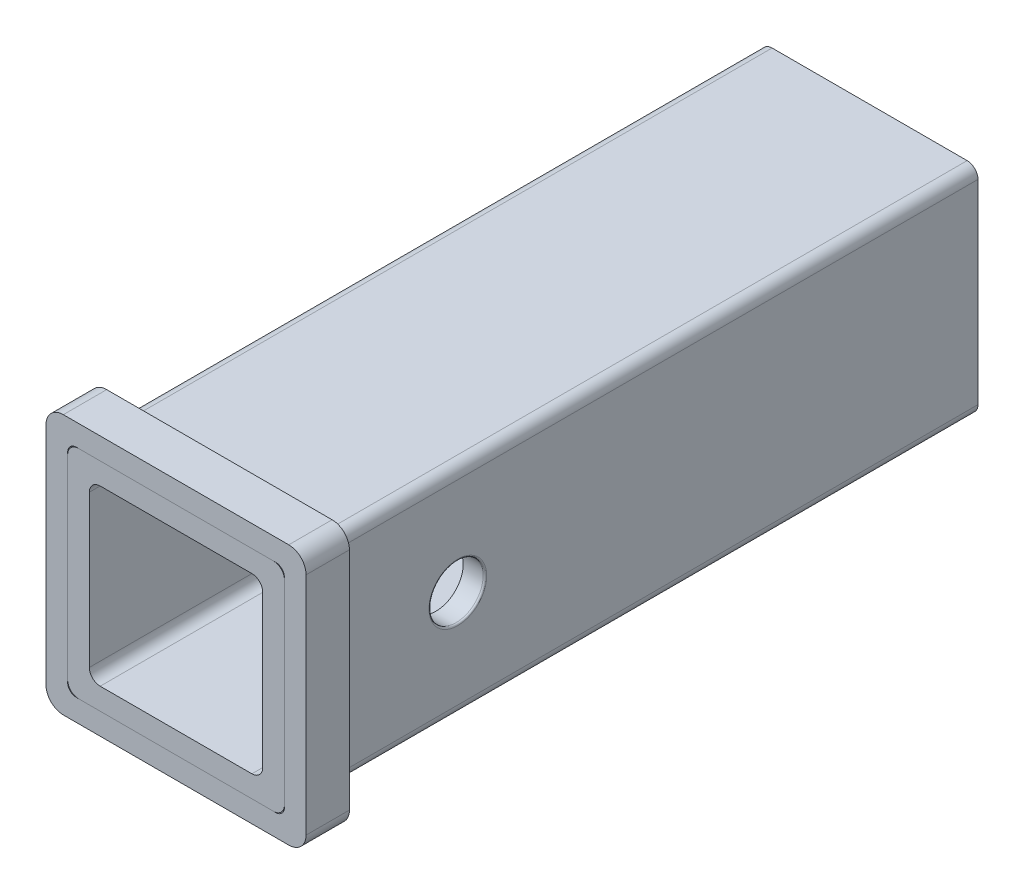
ISO-10303-21;
HEADER;
FILE_DESCRIPTION(('STEP AP214'),'2;1');
FILE_NAME('part.step','',(''),(''),'','','');
FILE_SCHEMA(('AUTOMOTIVE_DESIGN { 1 0 10303 214 1 1 1 1 }'));
ENDSEC;
DATA;
#1=APPLICATION_CONTEXT('core data for automotive mechanical design processes');
#2=APPLICATION_PROTOCOL_DEFINITION('international standard','automotive_design',2000,#1);
#3=PRODUCT_CONTEXT('',#1,'mechanical');
#4=PRODUCT('Part','Part','',(#3));
#5=PRODUCT_RELATED_PRODUCT_CATEGORY('part','',(#4));
#6=PRODUCT_DEFINITION_FORMATION('','',#4);
#7=PRODUCT_DEFINITION_CONTEXT('part definition',#1,'design');
#8=PRODUCT_DEFINITION('design','',#6,#7);
#9=PRODUCT_DEFINITION_SHAPE('','',#8);
#10=(LENGTH_UNIT() NAMED_UNIT(*) SI_UNIT(.MILLI.,.METRE.));
#11=(NAMED_UNIT(*) PLANE_ANGLE_UNIT() SI_UNIT($,.RADIAN.));
#12=(NAMED_UNIT(*) SI_UNIT($,.STERADIAN.) SOLID_ANGLE_UNIT());
#13=UNCERTAINTY_MEASURE_WITH_UNIT(LENGTH_MEASURE(1.E-05),#10,'distance_accuracy_value','');
#14=(GEOMETRIC_REPRESENTATION_CONTEXT(3) GLOBAL_UNCERTAINTY_ASSIGNED_CONTEXT((#13)) GLOBAL_UNIT_ASSIGNED_CONTEXT((#10,
#11,#12)) REPRESENTATION_CONTEXT('',''));
#15=CARTESIAN_POINT('',(0.,0.,0.));
#16=DIRECTION('',(0.,0.,1.));
#17=DIRECTION('',(1.,0.,0.));
#18=AXIS2_PLACEMENT_3D('',#15,#16,#17);
#19=CARTESIAN_POINT('',(38.1,38.1,-12.7));
#20=DIRECTION('',(1.,0.,0.));
#21=DIRECTION('',(0.,0.,-1.));
#22=AXIS2_PLACEMENT_3D('',#19,#20,#21);
#23=PLANE('',#22);
#24=DIRECTION('',(0.,1.,0.));
#25=VECTOR('',#24,1.);
#26=CARTESIAN_POINT('',(38.1,38.1,0.));
#27=LINE('',#26,#25);
#28=CARTESIAN_POINT('',(38.1,-33.02,0.));
#29=VERTEX_POINT('',#28);
#30=CARTESIAN_POINT('',(38.1,33.02,0.));
#31=VERTEX_POINT('',#30);
#32=EDGE_CURVE('E284',#29,#31,#27,.T.);
#33=ORIENTED_EDGE('',*,*,#32,.F.);
#34=DIRECTION('',(0.,0.,1.));
#35=VECTOR('',#34,1.);
#36=CARTESIAN_POINT('',(38.1,-33.02,-12.7));
#37=LINE('',#36,#35);
#38=CARTESIAN_POINT('',(38.1,-33.02,-12.7));
#39=VERTEX_POINT('',#38);
#40=EDGE_CURVE('E222',#29,#39,#37,.F.);
#41=ORIENTED_EDGE('',*,*,#40,.T.);
#42=DIRECTION('',(0.,1.,0.));
#43=VECTOR('',#42,1.);
#44=CARTESIAN_POINT('',(38.1,38.1,-12.7));
#45=LINE('',#44,#43);
#46=CARTESIAN_POINT('',(38.1,33.02,-12.7));
#47=VERTEX_POINT('',#46);
#48=EDGE_CURVE('E291',#39,#47,#45,.T.);
#49=ORIENTED_EDGE('',*,*,#48,.T.);
#50=DIRECTION('',(0.,0.,1.));
#51=VECTOR('',#50,1.);
#52=CARTESIAN_POINT('',(38.1,33.02,-12.7));
#53=LINE('',#52,#51);
#54=EDGE_CURVE('E219',#47,#31,#53,.T.);
#55=ORIENTED_EDGE('',*,*,#54,.T.);
#56=EDGE_LOOP('',(#33,#41,#49,#55));
#57=FACE_BOUND('',#56,.T.);
#58=ADVANCED_FACE('F51',(#57),#23,.T.);
#59=CARTESIAN_POINT('',(-38.1,-38.1,-12.7));
#60=DIRECTION('',(0.,-1.,0.));
#61=DIRECTION('',(0.,0.,-1.));
#62=AXIS2_PLACEMENT_3D('',#59,#60,#61);
#63=PLANE('',#62);
#64=DIRECTION('',(1.,0.,0.));
#65=VECTOR('',#64,1.);
#66=CARTESIAN_POINT('',(-38.1,-38.1,0.));
#67=LINE('',#66,#65);
#68=CARTESIAN_POINT('',(-33.02,-38.1,0.));
#69=VERTEX_POINT('',#68);
#70=CARTESIAN_POINT('',(33.02,-38.1,0.));
#71=VERTEX_POINT('',#70);
#72=EDGE_CURVE('E186',#69,#71,#67,.T.);
#73=ORIENTED_EDGE('',*,*,#72,.F.);
#74=DIRECTION('',(0.,0.,1.));
#75=VECTOR('',#74,1.);
#76=CARTESIAN_POINT('',(-33.02,-38.1,-12.7));
#77=LINE('',#76,#75);
#78=CARTESIAN_POINT('',(-33.02,-38.1,-12.7));
#79=VERTEX_POINT('',#78);
#80=EDGE_CURVE('E206',#69,#79,#77,.F.);
#81=ORIENTED_EDGE('',*,*,#80,.T.);
#82=DIRECTION('',(1.,0.,0.));
#83=VECTOR('',#82,1.);
#84=CARTESIAN_POINT('',(-38.1,-38.1,-12.7));
#85=LINE('',#84,#83);
#86=CARTESIAN_POINT('',(33.02,-38.1,-12.7));
#87=VERTEX_POINT('',#86);
#88=EDGE_CURVE('E191',#79,#87,#85,.T.);
#89=ORIENTED_EDGE('',*,*,#88,.T.);
#90=DIRECTION('',(0.,0.,1.));
#91=VECTOR('',#90,1.);
#92=CARTESIAN_POINT('',(33.02,-38.1,-12.7));
#93=LINE('',#92,#91);
#94=EDGE_CURVE('E203',#87,#71,#93,.T.);
#95=ORIENTED_EDGE('',*,*,#94,.T.);
#96=EDGE_LOOP('',(#73,#81,#89,#95));
#97=FACE_BOUND('',#96,.T.);
#98=ADVANCED_FACE('F314',(#97),#63,.T.);
#99=CARTESIAN_POINT('',(-38.1,38.1,-12.7));
#100=DIRECTION('',(-1.,0.,0.));
#101=DIRECTION('',(0.,0.,1.));
#102=AXIS2_PLACEMENT_3D('',#99,#100,#101);
#103=PLANE('',#102);
#104=DIRECTION('',(0.,-1.,0.));
#105=VECTOR('',#104,1.);
#106=CARTESIAN_POINT('',(-38.1,38.1,-12.7));
#107=LINE('',#106,#105);
#108=CARTESIAN_POINT('',(-38.1,33.02,-12.7));
#109=VERTEX_POINT('',#108);
#110=CARTESIAN_POINT('',(-38.1,-33.02,-12.7));
#111=VERTEX_POINT('',#110);
#112=EDGE_CURVE('E196',#109,#111,#107,.T.);
#113=ORIENTED_EDGE('',*,*,#112,.T.);
#114=DIRECTION('',(0.,0.,1.));
#115=VECTOR('',#114,1.);
#116=CARTESIAN_POINT('',(-38.1,-33.02,-12.7));
#117=LINE('',#116,#115);
#118=CARTESIAN_POINT('',(-38.1,-33.02,0.));
#119=VERTEX_POINT('',#118);
#120=EDGE_CURVE('E185',#111,#119,#117,.T.);
#121=ORIENTED_EDGE('',*,*,#120,.T.);
#122=DIRECTION('',(0.,-1.,0.));
#123=VECTOR('',#122,1.);
#124=CARTESIAN_POINT('',(-38.1,38.1,0.));
#125=LINE('',#124,#123);
#126=CARTESIAN_POINT('',(-38.1,33.02,0.));
#127=VERTEX_POINT('',#126);
#128=EDGE_CURVE('E168',#127,#119,#125,.T.);
#129=ORIENTED_EDGE('',*,*,#128,.F.);
#130=DIRECTION('',(0.,0.,1.));
#131=VECTOR('',#130,1.);
#132=CARTESIAN_POINT('',(-38.1,33.02,-12.7));
#133=LINE('',#132,#131);
#134=EDGE_CURVE('E182',#127,#109,#133,.F.);
#135=ORIENTED_EDGE('',*,*,#134,.T.);
#136=EDGE_LOOP('',(#113,#121,#129,#135));
#137=FACE_BOUND('',#136,.T.);
#138=ADVANCED_FACE('F181',(#137),#103,.T.);
#139=CARTESIAN_POINT('',(-38.1,38.1,-12.7));
#140=DIRECTION('',(0.,1.,0.));
#141=DIRECTION('',(0.,0.,1.));
#142=AXIS2_PLACEMENT_3D('',#139,#140,#141);
#143=PLANE('',#142);
#144=DIRECTION('',(-1.,0.,0.));
#145=VECTOR('',#144,1.);
#146=CARTESIAN_POINT('',(-38.1,38.1,-12.7));
#147=LINE('',#146,#145);
#148=CARTESIAN_POINT('',(33.02,38.1,-12.7));
#149=VERTEX_POINT('',#148);
#150=CARTESIAN_POINT('',(-33.02,38.1,-12.7));
#151=VERTEX_POINT('',#150);
#152=EDGE_CURVE('E294',#149,#151,#147,.T.);
#153=ORIENTED_EDGE('',*,*,#152,.T.);
#154=DIRECTION('',(0.,0.,1.));
#155=VECTOR('',#154,1.);
#156=CARTESIAN_POINT('',(-33.02,38.1,-12.7));
#157=LINE('',#156,#155);
#158=CARTESIAN_POINT('',(-33.02,38.1,0.));
#159=VERTEX_POINT('',#158);
#160=EDGE_CURVE('E217',#151,#159,#157,.T.);
#161=ORIENTED_EDGE('',*,*,#160,.T.);
#162=DIRECTION('',(-1.,0.,0.));
#163=VECTOR('',#162,1.);
#164=CARTESIAN_POINT('',(-38.1,38.1,0.));
#165=LINE('',#164,#163);
#166=CARTESIAN_POINT('',(33.02,38.1,0.));
#167=VERTEX_POINT('',#166);
#168=EDGE_CURVE('E170',#167,#159,#165,.T.);
#169=ORIENTED_EDGE('',*,*,#168,.F.);
#170=DIRECTION('',(0.,0.,1.));
#171=VECTOR('',#170,1.);
#172=CARTESIAN_POINT('',(33.02,38.1,-12.7));
#173=LINE('',#172,#171);
#174=EDGE_CURVE('E215',#167,#149,#173,.F.);
#175=ORIENTED_EDGE('',*,*,#174,.T.);
#176=EDGE_LOOP('',(#153,#161,#169,#175));
#177=FACE_BOUND('',#176,.T.);
#178=ADVANCED_FACE('F321',(#177),#143,.T.);
#179=CARTESIAN_POINT('',(0.,0.,-12.7));
#180=DIRECTION('',(0.,0.,1.));
#181=DIRECTION('',(1.,0.,0.));
#182=AXIS2_PLACEMENT_3D('',#179,#180,#181);
#183=PLANE('',#182);
#184=DIRECTION('',(0.,1.,0.));
#185=VECTOR('',#184,1.);
#186=CARTESIAN_POINT('',(31.75,31.75,-12.7));
#187=LINE('',#186,#185);
#188=CARTESIAN_POINT('',(31.75,-29.21,-12.7));
#189=VERTEX_POINT('',#188);
#190=CARTESIAN_POINT('',(31.75,29.21,-12.7));
#191=VERTEX_POINT('',#190);
#192=EDGE_CURVE('E279',#189,#191,#187,.T.);
#193=ORIENTED_EDGE('',*,*,#192,.T.);
#194=CARTESIAN_POINT('',(29.21,29.21,-12.7));
#195=DIRECTION('',(0.,0.,1.));
#196=DIRECTION('',(1.,0.,0.));
#197=AXIS2_PLACEMENT_3D('',#194,#195,#196);
#198=CIRCLE('',#197,2.54);
#199=CARTESIAN_POINT('',(29.21,31.75,-12.7));
#200=VERTEX_POINT('',#199);
#201=EDGE_CURVE('E73',#191,#200,#198,.T.);
#202=ORIENTED_EDGE('',*,*,#201,.T.);
#203=DIRECTION('',(-1.,0.,0.));
#204=VECTOR('',#203,1.);
#205=CARTESIAN_POINT('',(-31.75,31.75,-12.7));
#206=LINE('',#205,#204);
#207=CARTESIAN_POINT('',(-29.21,31.75,-12.7));
#208=VERTEX_POINT('',#207);
#209=EDGE_CURVE('E272',#200,#208,#206,.T.);
#210=ORIENTED_EDGE('',*,*,#209,.T.);
#211=CARTESIAN_POINT('',(-29.21,29.21,-12.7));
#212=DIRECTION('',(0.,0.,1.));
#213=DIRECTION('',(1.,0.,0.));
#214=AXIS2_PLACEMENT_3D('',#211,#212,#213);
#215=CIRCLE('',#214,2.54);
#216=CARTESIAN_POINT('',(-31.75,29.21,-12.7));
#217=VERTEX_POINT('',#216);
#218=EDGE_CURVE('E12',#208,#217,#215,.T.);
#219=ORIENTED_EDGE('',*,*,#218,.T.);
#220=DIRECTION('',(0.,-1.,0.));
#221=VECTOR('',#220,1.);
#222=CARTESIAN_POINT('',(-31.75,31.75,-12.7));
#223=LINE('',#222,#221);
#224=CARTESIAN_POINT('',(-31.75,-29.21,-12.7));
#225=VERTEX_POINT('',#224);
#226=EDGE_CURVE('E263',#217,#225,#223,.T.);
#227=ORIENTED_EDGE('',*,*,#226,.T.);
#228=CARTESIAN_POINT('',(-29.21,-29.21,-12.7));
#229=DIRECTION('',(0.,0.,1.));
#230=DIRECTION('',(1.,0.,0.));
#231=AXIS2_PLACEMENT_3D('',#228,#229,#230);
#232=CIRCLE('',#231,2.54);
#233=CARTESIAN_POINT('',(-29.21,-31.75,-12.7));
#234=VERTEX_POINT('',#233);
#235=EDGE_CURVE('E249',#225,#234,#232,.T.);
#236=ORIENTED_EDGE('',*,*,#235,.T.);
#237=DIRECTION('',(1.,0.,0.));
#238=VECTOR('',#237,1.);
#239=CARTESIAN_POINT('',(-31.75,-31.75,-12.7));
#240=LINE('',#239,#238);
#241=CARTESIAN_POINT('',(29.21,-31.75,-12.7));
#242=VERTEX_POINT('',#241);
#243=EDGE_CURVE('E276',#234,#242,#240,.T.);
#244=ORIENTED_EDGE('',*,*,#243,.T.);
#245=CARTESIAN_POINT('',(29.21,-29.21,-12.7));
#246=DIRECTION('',(0.,0.,1.));
#247=DIRECTION('',(1.,0.,0.));
#248=AXIS2_PLACEMENT_3D('',#245,#246,#247);
#249=CIRCLE('',#248,2.54);
#250=EDGE_CURVE('E245',#242,#189,#249,.T.);
#251=ORIENTED_EDGE('',*,*,#250,.T.);
#252=EDGE_LOOP('',(#193,#202,#210,#219,#227,#236,#244,#251));
#253=FACE_BOUND('',#252,.T.);
#254=ORIENTED_EDGE('',*,*,#88,.F.);
#255=CARTESIAN_POINT('',(-33.02,-33.02,-12.7));
#256=DIRECTION('',(0.,0.,1.));
#257=DIRECTION('',(1.,0.,0.));
#258=AXIS2_PLACEMENT_3D('',#255,#256,#257);
#259=CIRCLE('',#258,5.08);
#260=EDGE_CURVE('E213',#79,#111,#259,.F.);
#261=ORIENTED_EDGE('',*,*,#260,.T.);
#262=ORIENTED_EDGE('',*,*,#112,.F.);
#263=CARTESIAN_POINT('',(-33.02,33.02,-12.7));
#264=DIRECTION('',(0.,0.,1.));
#265=DIRECTION('',(1.,0.,0.));
#266=AXIS2_PLACEMENT_3D('',#263,#264,#265);
#267=CIRCLE('',#266,5.08);
#268=EDGE_CURVE('E190',#109,#151,#267,.F.);
#269=ORIENTED_EDGE('',*,*,#268,.T.);
#270=ORIENTED_EDGE('',*,*,#152,.F.);
#271=CARTESIAN_POINT('',(33.02,33.02,-12.7));
#272=DIRECTION('',(0.,0.,1.));
#273=DIRECTION('',(1.,0.,0.));
#274=AXIS2_PLACEMENT_3D('',#271,#272,#273);
#275=CIRCLE('',#274,5.08);
#276=EDGE_CURVE('E208',#149,#47,#275,.F.);
#277=ORIENTED_EDGE('',*,*,#276,.T.);
#278=ORIENTED_EDGE('',*,*,#48,.F.);
#279=CARTESIAN_POINT('',(33.02,-33.02,-12.7));
#280=DIRECTION('',(0.,0.,1.));
#281=DIRECTION('',(1.,0.,0.));
#282=AXIS2_PLACEMENT_3D('',#279,#280,#281);
#283=CIRCLE('',#282,5.08);
#284=EDGE_CURVE('E210',#39,#87,#283,.F.);
#285=ORIENTED_EDGE('',*,*,#284,.T.);
#286=EDGE_LOOP('',(#254,#261,#262,#269,#270,#277,#278,#285));
#287=FACE_BOUND('',#286,.T.);
#288=ADVANCED_FACE('F269',(#253,#287),#183,.F.);
#289=CARTESIAN_POINT('',(0.,0.,0.));
#290=DIRECTION('',(0.,0.,1.));
#291=DIRECTION('',(1.,0.,0.));
#292=AXIS2_PLACEMENT_3D('',#289,#290,#291);
#293=PLANE('',#292);
#294=DIRECTION('',(0.,-1.,0.));
#295=VECTOR('',#294,1.);
#296=CARTESIAN_POINT('',(-31.75,31.75,0.));
#297=LINE('',#296,#295);
#298=CARTESIAN_POINT('',(-31.75,29.21,0.));
#299=VERTEX_POINT('',#298);
#300=CARTESIAN_POINT('',(-31.75,-29.21,0.));
#301=VERTEX_POINT('',#300);
#302=EDGE_CURVE('E258',#299,#301,#297,.T.);
#303=ORIENTED_EDGE('',*,*,#302,.F.);
#304=CARTESIAN_POINT('',(-29.21,29.21,0.));
#305=DIRECTION('',(0.,0.,1.));
#306=DIRECTION('',(1.,0.,0.));
#307=AXIS2_PLACEMENT_3D('',#304,#305,#306);
#308=CIRCLE('',#307,2.54);
#309=CARTESIAN_POINT('',(-29.21,31.75,0.));
#310=VERTEX_POINT('',#309);
#311=EDGE_CURVE('E59',#299,#310,#308,.F.);
#312=ORIENTED_EDGE('',*,*,#311,.T.);
#313=DIRECTION('',(-1.,0.,0.));
#314=VECTOR('',#313,1.);
#315=CARTESIAN_POINT('',(-31.75,31.75,0.));
#316=LINE('',#315,#314);
#317=CARTESIAN_POINT('',(29.21,31.75,0.));
#318=VERTEX_POINT('',#317);
#319=EDGE_CURVE('E256',#318,#310,#316,.T.);
#320=ORIENTED_EDGE('',*,*,#319,.F.);
#321=CARTESIAN_POINT('',(29.21,29.21,0.));
#322=DIRECTION('',(0.,0.,1.));
#323=DIRECTION('',(1.,0.,0.));
#324=AXIS2_PLACEMENT_3D('',#321,#322,#323);
#325=CIRCLE('',#324,2.54);
#326=CARTESIAN_POINT('',(31.75,29.21,0.));
#327=VERTEX_POINT('',#326);
#328=EDGE_CURVE('E251',#318,#327,#325,.F.);
#329=ORIENTED_EDGE('',*,*,#328,.T.);
#330=DIRECTION('',(0.,1.,0.));
#331=VECTOR('',#330,1.);
#332=CARTESIAN_POINT('',(31.75,31.75,0.));
#333=LINE('',#332,#331);
#334=CARTESIAN_POINT('',(31.75,-29.21,0.));
#335=VERTEX_POINT('',#334);
#336=EDGE_CURVE('E264',#335,#327,#333,.T.);
#337=ORIENTED_EDGE('',*,*,#336,.F.);
#338=CARTESIAN_POINT('',(29.21,-29.21,0.));
#339=DIRECTION('',(0.,0.,1.));
#340=DIRECTION('',(1.,0.,0.));
#341=AXIS2_PLACEMENT_3D('',#338,#339,#340);
#342=CIRCLE('',#341,2.54);
#343=CARTESIAN_POINT('',(29.21,-31.75,0.));
#344=VERTEX_POINT('',#343);
#345=EDGE_CURVE('E243',#335,#344,#342,.F.);
#346=ORIENTED_EDGE('',*,*,#345,.T.);
#347=DIRECTION('',(1.,0.,0.));
#348=VECTOR('',#347,1.);
#349=CARTESIAN_POINT('',(-31.75,-31.75,0.));
#350=LINE('',#349,#348);
#351=CARTESIAN_POINT('',(-29.21,-31.75,0.));
#352=VERTEX_POINT('',#351);
#353=EDGE_CURVE('E286',#352,#344,#350,.T.);
#354=ORIENTED_EDGE('',*,*,#353,.F.);
#355=CARTESIAN_POINT('',(-29.21,-29.21,0.));
#356=DIRECTION('',(0.,0.,1.));
#357=DIRECTION('',(1.,0.,0.));
#358=AXIS2_PLACEMENT_3D('',#355,#356,#357);
#359=CIRCLE('',#358,2.54);
#360=EDGE_CURVE('E247',#352,#301,#359,.F.);
#361=ORIENTED_EDGE('',*,*,#360,.T.);
#362=EDGE_LOOP('',(#303,#312,#320,#329,#337,#346,#354,#361));
#363=FACE_BOUND('',#362,.T.);
#364=ORIENTED_EDGE('',*,*,#128,.T.);
#365=CARTESIAN_POINT('',(-33.02,-33.02,0.));
#366=DIRECTION('',(0.,0.,1.));
#367=DIRECTION('',(1.,0.,0.));
#368=AXIS2_PLACEMENT_3D('',#365,#366,#367);
#369=CIRCLE('',#368,5.08);
#370=EDGE_CURVE('E175',#119,#69,#369,.T.);
#371=ORIENTED_EDGE('',*,*,#370,.T.);
#372=ORIENTED_EDGE('',*,*,#72,.T.);
#373=CARTESIAN_POINT('',(33.02,-33.02,0.));
#374=DIRECTION('',(0.,0.,1.));
#375=DIRECTION('',(1.,0.,0.));
#376=AXIS2_PLACEMENT_3D('',#373,#374,#375);
#377=CIRCLE('',#376,5.08);
#378=EDGE_CURVE('E176',#71,#29,#377,.T.);
#379=ORIENTED_EDGE('',*,*,#378,.T.);
#380=ORIENTED_EDGE('',*,*,#32,.T.);
#381=CARTESIAN_POINT('',(33.02,33.02,0.));
#382=DIRECTION('',(0.,0.,1.));
#383=DIRECTION('',(1.,0.,0.));
#384=AXIS2_PLACEMENT_3D('',#381,#382,#383);
#385=CIRCLE('',#384,5.08);
#386=EDGE_CURVE('E193',#31,#167,#385,.T.);
#387=ORIENTED_EDGE('',*,*,#386,.T.);
#388=ORIENTED_EDGE('',*,*,#168,.T.);
#389=CARTESIAN_POINT('',(-33.02,33.02,0.));
#390=DIRECTION('',(0.,0.,1.));
#391=DIRECTION('',(1.,0.,0.));
#392=AXIS2_PLACEMENT_3D('',#389,#390,#391);
#393=CIRCLE('',#392,5.08);
#394=EDGE_CURVE('E165',#159,#127,#393,.T.);
#395=ORIENTED_EDGE('',*,*,#394,.T.);
#396=EDGE_LOOP('',(#364,#371,#372,#379,#380,#387,#388,#395));
#397=FACE_BOUND('',#396,.T.);
#398=ADVANCED_FACE('F167',(#363,#397),#293,.T.);
#399=CARTESIAN_POINT('',(-31.75,31.75,-12.7));
#400=DIRECTION('',(-1.,0.,0.));
#401=DIRECTION('',(0.,0.,1.));
#402=AXIS2_PLACEMENT_3D('',#399,#400,#401);
#403=PLANE('',#402);
#404=ORIENTED_EDGE('',*,*,#302,.T.);
#405=DIRECTION('',(0.,0.,1.));
#406=VECTOR('',#405,1.);
#407=CARTESIAN_POINT('',(-31.75,-29.21,-12.7));
#408=LINE('',#407,#406);
#409=EDGE_CURVE('E237',#301,#225,#408,.F.);
#410=ORIENTED_EDGE('',*,*,#409,.T.);
#411=ORIENTED_EDGE('',*,*,#226,.F.);
#412=DIRECTION('',(0.,0.,1.));
#413=VECTOR('',#412,1.);
#414=CARTESIAN_POINT('',(-31.75,29.21,0.));
#415=LINE('',#414,#413);
#416=EDGE_CURVE('E234',#217,#299,#415,.T.);
#417=ORIENTED_EDGE('',*,*,#416,.T.);
#418=EDGE_LOOP('',(#404,#410,#411,#417));
#419=FACE_BOUND('',#418,.T.);
#420=ADVANCED_FACE('F274',(#419),#403,.F.);
#421=CARTESIAN_POINT('',(-31.75,31.75,-12.7));
#422=DIRECTION('',(0.,1.,0.));
#423=DIRECTION('',(0.,0.,1.));
#424=AXIS2_PLACEMENT_3D('',#421,#422,#423);
#425=PLANE('',#424);
#426=ORIENTED_EDGE('',*,*,#209,.F.);
#427=DIRECTION('',(0.,0.,1.));
#428=VECTOR('',#427,1.);
#429=CARTESIAN_POINT('',(29.21,31.75,0.));
#430=LINE('',#429,#428);
#431=EDGE_CURVE('E240',#200,#318,#430,.T.);
#432=ORIENTED_EDGE('',*,*,#431,.T.);
#433=ORIENTED_EDGE('',*,*,#319,.T.);
#434=DIRECTION('',(0.,0.,1.));
#435=VECTOR('',#434,1.);
#436=CARTESIAN_POINT('',(-29.21,31.75,-12.7));
#437=LINE('',#436,#435);
#438=EDGE_CURVE('E66',#310,#208,#437,.F.);
#439=ORIENTED_EDGE('',*,*,#438,.T.);
#440=EDGE_LOOP('',(#426,#432,#433,#439));
#441=FACE_BOUND('',#440,.T.);
#442=ADVANCED_FACE('F261',(#441),#425,.F.);
#443=CARTESIAN_POINT('',(31.75,31.75,-12.7));
#444=DIRECTION('',(1.,0.,0.));
#445=DIRECTION('',(0.,0.,-1.));
#446=AXIS2_PLACEMENT_3D('',#443,#444,#445);
#447=PLANE('',#446);
#448=ORIENTED_EDGE('',*,*,#192,.F.);
#449=DIRECTION('',(0.,0.,1.));
#450=VECTOR('',#449,1.);
#451=CARTESIAN_POINT('',(31.75,-29.21,0.));
#452=LINE('',#451,#450);
#453=EDGE_CURVE('E226',#189,#335,#452,.T.);
#454=ORIENTED_EDGE('',*,*,#453,.T.);
#455=ORIENTED_EDGE('',*,*,#336,.T.);
#456=DIRECTION('',(0.,0.,1.));
#457=VECTOR('',#456,1.);
#458=CARTESIAN_POINT('',(31.75,29.21,-12.7));
#459=LINE('',#458,#457);
#460=EDGE_CURVE('E224',#327,#191,#459,.F.);
#461=ORIENTED_EDGE('',*,*,#460,.T.);
#462=EDGE_LOOP('',(#448,#454,#455,#461));
#463=FACE_BOUND('',#462,.T.);
#464=ADVANCED_FACE('F398',(#463),#447,.F.);
#465=CARTESIAN_POINT('',(-31.75,-31.75,-12.7));
#466=DIRECTION('',(0.,-1.,0.));
#467=DIRECTION('',(0.,0.,-1.));
#468=AXIS2_PLACEMENT_3D('',#465,#466,#467);
#469=PLANE('',#468);
#470=ORIENTED_EDGE('',*,*,#353,.T.);
#471=DIRECTION('',(0.,0.,1.));
#472=VECTOR('',#471,1.);
#473=CARTESIAN_POINT('',(29.21,-31.75,-12.7));
#474=LINE('',#473,#472);
#475=EDGE_CURVE('E232',#344,#242,#474,.F.);
#476=ORIENTED_EDGE('',*,*,#475,.T.);
#477=ORIENTED_EDGE('',*,*,#243,.F.);
#478=DIRECTION('',(0.,0.,1.));
#479=VECTOR('',#478,1.);
#480=CARTESIAN_POINT('',(-29.21,-31.75,0.));
#481=LINE('',#480,#479);
#482=EDGE_CURVE('E229',#234,#352,#481,.T.);
#483=ORIENTED_EDGE('',*,*,#482,.T.);
#484=EDGE_LOOP('',(#470,#476,#477,#483));
#485=FACE_BOUND('',#484,.T.);
#486=ADVANCED_FACE('F347',(#485),#469,.F.);
#487=CARTESIAN_POINT('',(-33.02,-33.02,-12.7));
#488=DIRECTION('',(0.,0.,1.));
#489=DIRECTION('',(1.,0.,0.));
#490=AXIS2_PLACEMENT_3D('',#487,#488,#489);
#491=CYLINDRICAL_SURFACE('',#490,5.08);
#492=ORIENTED_EDGE('',*,*,#260,.F.);
#493=ORIENTED_EDGE('',*,*,#80,.F.);
#494=ORIENTED_EDGE('',*,*,#370,.F.);
#495=ORIENTED_EDGE('',*,*,#120,.F.);
#496=EDGE_LOOP('',(#492,#493,#494,#495));
#497=FACE_BOUND('',#496,.T.);
#498=ADVANCED_FACE('F317',(#497),#491,.T.);
#499=CARTESIAN_POINT('',(-33.02,33.02,-12.7));
#500=DIRECTION('',(0.,0.,1.));
#501=DIRECTION('',(1.,0.,0.));
#502=AXIS2_PLACEMENT_3D('',#499,#500,#501);
#503=CYLINDRICAL_SURFACE('',#502,5.08);
#504=ORIENTED_EDGE('',*,*,#268,.F.);
#505=ORIENTED_EDGE('',*,*,#134,.F.);
#506=ORIENTED_EDGE('',*,*,#394,.F.);
#507=ORIENTED_EDGE('',*,*,#160,.F.);
#508=EDGE_LOOP('',(#504,#505,#506,#507));
#509=FACE_BOUND('',#508,.T.);
#510=ADVANCED_FACE('F189',(#509),#503,.T.);
#511=CARTESIAN_POINT('',(33.02,-33.02,-12.7));
#512=DIRECTION('',(0.,0.,1.));
#513=DIRECTION('',(1.,0.,0.));
#514=AXIS2_PLACEMENT_3D('',#511,#512,#513);
#515=CYLINDRICAL_SURFACE('',#514,5.08);
#516=ORIENTED_EDGE('',*,*,#284,.F.);
#517=ORIENTED_EDGE('',*,*,#40,.F.);
#518=ORIENTED_EDGE('',*,*,#378,.F.);
#519=ORIENTED_EDGE('',*,*,#94,.F.);
#520=EDGE_LOOP('',(#516,#517,#518,#519));
#521=FACE_BOUND('',#520,.T.);
#522=ADVANCED_FACE('F308',(#521),#515,.T.);
#523=CARTESIAN_POINT('',(33.02,33.02,-12.7));
#524=DIRECTION('',(0.,0.,1.));
#525=DIRECTION('',(1.,0.,0.));
#526=AXIS2_PLACEMENT_3D('',#523,#524,#525);
#527=CYLINDRICAL_SURFACE('',#526,5.08);
#528=ORIENTED_EDGE('',*,*,#276,.F.);
#529=ORIENTED_EDGE('',*,*,#174,.F.);
#530=ORIENTED_EDGE('',*,*,#386,.F.);
#531=ORIENTED_EDGE('',*,*,#54,.F.);
#532=EDGE_LOOP('',(#528,#529,#530,#531));
#533=FACE_BOUND('',#532,.T.);
#534=ADVANCED_FACE('F324',(#533),#527,.T.);
#535=CARTESIAN_POINT('',(29.21,-29.21,-12.7));
#536=DIRECTION('',(0.,0.,-1.));
#537=DIRECTION('',(-1.,0.,0.));
#538=AXIS2_PLACEMENT_3D('',#535,#536,#537);
#539=CYLINDRICAL_SURFACE('',#538,2.54);
#540=ORIENTED_EDGE('',*,*,#250,.F.);
#541=ORIENTED_EDGE('',*,*,#475,.F.);
#542=ORIENTED_EDGE('',*,*,#345,.F.);
#543=ORIENTED_EDGE('',*,*,#453,.F.);
#544=EDGE_LOOP('',(#540,#541,#542,#543));
#545=FACE_BOUND('',#544,.T.);
#546=ADVANCED_FACE('F326',(#545),#539,.F.);
#547=CARTESIAN_POINT('',(-29.21,-29.21,-12.7));
#548=DIRECTION('',(0.,0.,-1.));
#549=DIRECTION('',(-1.,0.,0.));
#550=AXIS2_PLACEMENT_3D('',#547,#548,#549);
#551=CYLINDRICAL_SURFACE('',#550,2.54);
#552=ORIENTED_EDGE('',*,*,#235,.F.);
#553=ORIENTED_EDGE('',*,*,#409,.F.);
#554=ORIENTED_EDGE('',*,*,#360,.F.);
#555=ORIENTED_EDGE('',*,*,#482,.F.);
#556=EDGE_LOOP('',(#552,#553,#554,#555));
#557=FACE_BOUND('',#556,.T.);
#558=ADVANCED_FACE('F332',(#557),#551,.F.);
#559=CARTESIAN_POINT('',(29.21,29.21,-12.7));
#560=DIRECTION('',(0.,0.,-1.));
#561=DIRECTION('',(-1.,0.,0.));
#562=AXIS2_PLACEMENT_3D('',#559,#560,#561);
#563=CYLINDRICAL_SURFACE('',#562,2.54);
#564=ORIENTED_EDGE('',*,*,#201,.F.);
#565=ORIENTED_EDGE('',*,*,#460,.F.);
#566=ORIENTED_EDGE('',*,*,#328,.F.);
#567=ORIENTED_EDGE('',*,*,#431,.F.);
#568=EDGE_LOOP('',(#564,#565,#566,#567));
#569=FACE_BOUND('',#568,.T.);
#570=ADVANCED_FACE('F430',(#569),#563,.F.);
#571=CARTESIAN_POINT('',(-29.21,29.21,-12.7));
#572=DIRECTION('',(0.,0.,-1.));
#573=DIRECTION('',(-1.,0.,0.));
#574=AXIS2_PLACEMENT_3D('',#571,#572,#573);
#575=CYLINDRICAL_SURFACE('',#574,2.54);
#576=ORIENTED_EDGE('',*,*,#218,.F.);
#577=ORIENTED_EDGE('',*,*,#438,.F.);
#578=ORIENTED_EDGE('',*,*,#311,.F.);
#579=ORIENTED_EDGE('',*,*,#416,.F.);
#580=EDGE_LOOP('',(#576,#577,#578,#579));
#581=FACE_BOUND('',#580,.T.);
#582=ADVANCED_FACE('F53',(#581),#575,.F.);
#583=CLOSED_SHELL('',(#58,#98,#138,#178,#288,#398,#420,#442,#464,#486,#498,#510,#522,#534,#546,
#558,#570,#582));
#584=MANIFOLD_SOLID_BREP('B2',#583);
#585=CARTESIAN_POINT('',(-31.75,31.75,-203.2));
#586=DIRECTION('',(-1.,0.,0.));
#587=DIRECTION('',(0.,0.,1.));
#588=AXIS2_PLACEMENT_3D('',#585,#586,#587);
#589=PLANE('',#588);
#590=CARTESIAN_POINT('',(-31.75,0.,-50.8));
#591=DIRECTION('',(-1.,0.,0.));
#592=DIRECTION('',(0.,0.,1.));
#593=AXIS2_PLACEMENT_3D('',#590,#591,#592);
#594=CIRCLE('',#593,8.4455);
#595=CARTESIAN_POINT('',(-31.75,0.,-42.3545));
#596=VERTEX_POINT('',#595);
#597=EDGE_CURVE('E732',#596,#596,#594,.F.);
#598=ORIENTED_EDGE('',*,*,#597,.T.);
#599=EDGE_LOOP('',(#598));
#600=FACE_BOUND('',#599,.T.);
#601=DIRECTION('',(0.,-1.,0.));
#602=VECTOR('',#601,1.);
#603=CARTESIAN_POINT('',(-31.75,31.75,-203.2));
#604=LINE('',#603,#602);
#605=CARTESIAN_POINT('',(-31.75,28.575,-203.2));
#606=VERTEX_POINT('',#605);
#607=CARTESIAN_POINT('',(-31.75,-28.575,-203.2));
#608=VERTEX_POINT('',#607);
#609=EDGE_CURVE('E642',#606,#608,#604,.T.);
#610=ORIENTED_EDGE('',*,*,#609,.T.);
#611=DIRECTION('',(0.,0.,1.));
#612=VECTOR('',#611,1.);
#613=CARTESIAN_POINT('',(-31.75,-28.575,-203.2));
#614=LINE('',#613,#612);
#615=CARTESIAN_POINT('',(-31.75,-28.575,0.));
#616=VERTEX_POINT('',#615);
#617=EDGE_CURVE('E677',#608,#616,#614,.T.);
#618=ORIENTED_EDGE('',*,*,#617,.T.);
#619=DIRECTION('',(0.,-1.,0.));
#620=VECTOR('',#619,1.);
#621=CARTESIAN_POINT('',(-31.75,31.75,0.));
#622=LINE('',#621,#620);
#623=CARTESIAN_POINT('',(-31.75,28.575,0.));
#624=VERTEX_POINT('',#623);
#625=EDGE_CURVE('E654',#624,#616,#622,.T.);
#626=ORIENTED_EDGE('',*,*,#625,.F.);
#627=DIRECTION('',(0.,0.,1.));
#628=VECTOR('',#627,1.);
#629=CARTESIAN_POINT('',(-31.75,28.575,-203.2));
#630=LINE('',#629,#628);
#631=EDGE_CURVE('E675',#624,#606,#630,.F.);
#632=ORIENTED_EDGE('',*,*,#631,.T.);
#633=EDGE_LOOP('',(#610,#618,#626,#632));
#634=FACE_BOUND('',#633,.T.);
#635=ADVANCED_FACE('F488',(#600,#634),#589,.T.);
#636=CARTESIAN_POINT('',(-31.75,31.75,-203.2));
#637=DIRECTION('',(0.,1.,0.));
#638=DIRECTION('',(0.,0.,1.));
#639=AXIS2_PLACEMENT_3D('',#636,#637,#638);
#640=PLANE('',#639);
#641=DIRECTION('',(-1.,0.,0.));
#642=VECTOR('',#641,1.);
#643=CARTESIAN_POINT('',(-31.75,31.75,-203.2));
#644=LINE('',#643,#642);
#645=CARTESIAN_POINT('',(28.575,31.75,-203.2));
#646=VERTEX_POINT('',#645);
#647=CARTESIAN_POINT('',(-28.575,31.75,-203.2));
#648=VERTEX_POINT('',#647);
#649=EDGE_CURVE('E651',#646,#648,#644,.T.);
#650=ORIENTED_EDGE('',*,*,#649,.T.);
#651=DIRECTION('',(0.,0.,1.));
#652=VECTOR('',#651,1.);
#653=CARTESIAN_POINT('',(-28.575,31.75,-203.2));
#654=LINE('',#653,#652);
#655=CARTESIAN_POINT('',(-28.575,31.75,0.));
#656=VERTEX_POINT('',#655);
#657=EDGE_CURVE('E614',#648,#656,#654,.T.);
#658=ORIENTED_EDGE('',*,*,#657,.T.);
#659=DIRECTION('',(-1.,0.,0.));
#660=VECTOR('',#659,1.);
#661=CARTESIAN_POINT('',(-31.75,31.75,0.));
#662=LINE('',#661,#660);
#663=CARTESIAN_POINT('',(28.575,31.75,0.));
#664=VERTEX_POINT('',#663);
#665=EDGE_CURVE('E646',#664,#656,#662,.T.);
#666=ORIENTED_EDGE('',*,*,#665,.F.);
#667=DIRECTION('',(0.,0.,1.));
#668=VECTOR('',#667,1.);
#669=CARTESIAN_POINT('',(28.575,31.75,-203.2));
#670=LINE('',#669,#668);
#671=EDGE_CURVE('E709',#664,#646,#670,.F.);
#672=ORIENTED_EDGE('',*,*,#671,.T.);
#673=EDGE_LOOP('',(#650,#658,#666,#672));
#674=FACE_BOUND('',#673,.T.);
#675=ADVANCED_FACE('F750',(#674),#640,.T.);
#676=CARTESIAN_POINT('',(31.75,31.75,-203.2));
#677=DIRECTION('',(1.,0.,0.));
#678=DIRECTION('',(0.,0.,-1.));
#679=AXIS2_PLACEMENT_3D('',#676,#677,#678);
#680=PLANE('',#679);
#681=CARTESIAN_POINT('',(31.75,0.,-50.8));
#682=DIRECTION('',(1.,0.,0.));
#683=DIRECTION('',(0.,0.,-1.));
#684=AXIS2_PLACEMENT_3D('',#681,#682,#683);
#685=CIRCLE('',#684,8.4455);
#686=CARTESIAN_POINT('',(31.75,0.,-59.2455));
#687=VERTEX_POINT('',#686);
#688=EDGE_CURVE('E49',#687,#687,#685,.F.);
#689=ORIENTED_EDGE('',*,*,#688,.T.);
#690=EDGE_LOOP('',(#689));
#691=FACE_BOUND('',#690,.T.);
#692=DIRECTION('',(0.,1.,0.));
#693=VECTOR('',#692,1.);
#694=CARTESIAN_POINT('',(31.75,31.75,0.));
#695=LINE('',#694,#693);
#696=CARTESIAN_POINT('',(31.75,-28.575,0.));
#697=VERTEX_POINT('',#696);
#698=CARTESIAN_POINT('',(31.75,28.575,0.));
#699=VERTEX_POINT('',#698);
#700=EDGE_CURVE('E661',#697,#699,#695,.T.);
#701=ORIENTED_EDGE('',*,*,#700,.F.);
#702=DIRECTION('',(0.,0.,1.));
#703=VECTOR('',#702,1.);
#704=CARTESIAN_POINT('',(31.75,-28.575,-203.2));
#705=LINE('',#704,#703);
#706=CARTESIAN_POINT('',(31.75,-28.575,-203.2));
#707=VERTEX_POINT('',#706);
#708=EDGE_CURVE('E510',#697,#707,#705,.F.);
#709=ORIENTED_EDGE('',*,*,#708,.T.);
#710=DIRECTION('',(0.,1.,0.));
#711=VECTOR('',#710,1.);
#712=CARTESIAN_POINT('',(31.75,31.75,-203.2));
#713=LINE('',#712,#711);
#714=CARTESIAN_POINT('',(31.75,28.575,-203.2));
#715=VERTEX_POINT('',#714);
#716=EDGE_CURVE('E649',#707,#715,#713,.T.);
#717=ORIENTED_EDGE('',*,*,#716,.T.);
#718=DIRECTION('',(0.,0.,1.));
#719=VECTOR('',#718,1.);
#720=CARTESIAN_POINT('',(31.75,28.575,-203.2));
#721=LINE('',#720,#719);
#722=EDGE_CURVE('E700',#715,#699,#721,.T.);
#723=ORIENTED_EDGE('',*,*,#722,.T.);
#724=EDGE_LOOP('',(#701,#709,#717,#723));
#725=FACE_BOUND('',#724,.T.);
#726=ADVANCED_FACE('F756',(#691,#725),#680,.T.);
#727=CARTESIAN_POINT('',(-31.75,-31.75,-203.2));
#728=DIRECTION('',(0.,-1.,0.));
#729=DIRECTION('',(0.,0.,-1.));
#730=AXIS2_PLACEMENT_3D('',#727,#728,#729);
#731=PLANE('',#730);
#732=DIRECTION('',(1.,0.,0.));
#733=VECTOR('',#732,1.);
#734=CARTESIAN_POINT('',(-31.75,-31.75,0.));
#735=LINE('',#734,#733);
#736=CARTESIAN_POINT('',(-28.575,-31.75,0.));
#737=VERTEX_POINT('',#736);
#738=CARTESIAN_POINT('',(28.575,-31.75,0.));
#739=VERTEX_POINT('',#738);
#740=EDGE_CURVE('E657',#737,#739,#735,.T.);
#741=ORIENTED_EDGE('',*,*,#740,.F.);
#742=DIRECTION('',(0.,0.,1.));
#743=VECTOR('',#742,1.);
#744=CARTESIAN_POINT('',(-28.575,-31.75,-203.2));
#745=LINE('',#744,#743);
#746=CARTESIAN_POINT('',(-28.575,-31.75,-203.2));
#747=VERTEX_POINT('',#746);
#748=EDGE_CURVE('E691',#737,#747,#745,.F.);
#749=ORIENTED_EDGE('',*,*,#748,.T.);
#750=DIRECTION('',(1.,0.,0.));
#751=VECTOR('',#750,1.);
#752=CARTESIAN_POINT('',(-31.75,-31.75,-203.2));
#753=LINE('',#752,#751);
#754=CARTESIAN_POINT('',(28.575,-31.75,-203.2));
#755=VERTEX_POINT('',#754);
#756=EDGE_CURVE('E645',#747,#755,#753,.T.);
#757=ORIENTED_EDGE('',*,*,#756,.T.);
#758=DIRECTION('',(0.,0.,1.));
#759=VECTOR('',#758,1.);
#760=CARTESIAN_POINT('',(28.575,-31.75,-203.2));
#761=LINE('',#760,#759);
#762=EDGE_CURVE('E688',#755,#739,#761,.T.);
#763=ORIENTED_EDGE('',*,*,#762,.T.);
#764=EDGE_LOOP('',(#741,#749,#757,#763));
#765=FACE_BOUND('',#764,.T.);
#766=ADVANCED_FACE('F762',(#765),#731,.T.);
#767=CARTESIAN_POINT('',(0.,0.,-203.2));
#768=DIRECTION('',(0.,0.,1.));
#769=DIRECTION('',(1.,0.,0.));
#770=AXIS2_PLACEMENT_3D('',#767,#768,#769);
#771=PLANE('',#770);
#772=DIRECTION('',(0.,1.,0.));
#773=VECTOR('',#772,1.);
#774=CARTESIAN_POINT('',(25.4,25.4,-203.2));
#775=LINE('',#774,#773);
#776=CARTESIAN_POINT('',(25.4,-22.225,-203.2));
#777=VERTEX_POINT('',#776);
#778=CARTESIAN_POINT('',(25.4,22.225,-203.2));
#779=VERTEX_POINT('',#778);
#780=EDGE_CURVE('E623',#777,#779,#775,.T.);
#781=ORIENTED_EDGE('',*,*,#780,.T.);
#782=CARTESIAN_POINT('',(22.225,22.225,-203.2));
#783=DIRECTION('',(0.,0.,1.));
#784=DIRECTION('',(1.,0.,0.));
#785=AXIS2_PLACEMENT_3D('',#782,#783,#784);
#786=CIRCLE('',#785,3.175);
#787=CARTESIAN_POINT('',(22.225,25.4,-203.2));
#788=VERTEX_POINT('',#787);
#789=EDGE_CURVE('E719',#779,#788,#786,.T.);
#790=ORIENTED_EDGE('',*,*,#789,.T.);
#791=DIRECTION('',(-1.,0.,0.));
#792=VECTOR('',#791,1.);
#793=CARTESIAN_POINT('',(-25.4,25.4,-203.2));
#794=LINE('',#793,#792);
#795=CARTESIAN_POINT('',(-22.225,25.4,-203.2));
#796=VERTEX_POINT('',#795);
#797=EDGE_CURVE('E658',#788,#796,#794,.T.);
#798=ORIENTED_EDGE('',*,*,#797,.T.);
#799=CARTESIAN_POINT('',(-22.225,22.225,-203.2));
#800=DIRECTION('',(0.,0.,1.));
#801=DIRECTION('',(1.,0.,0.));
#802=AXIS2_PLACEMENT_3D('',#799,#800,#801);
#803=CIRCLE('',#802,3.175);
#804=CARTESIAN_POINT('',(-25.4,22.225,-203.2));
#805=VERTEX_POINT('',#804);
#806=EDGE_CURVE('E723',#796,#805,#803,.T.);
#807=ORIENTED_EDGE('',*,*,#806,.T.);
#808=DIRECTION('',(0.,-1.,0.));
#809=VECTOR('',#808,1.);
#810=CARTESIAN_POINT('',(-25.4,25.4,-203.2));
#811=LINE('',#810,#809);
#812=CARTESIAN_POINT('',(-25.4,-22.225,-203.2));
#813=VERTEX_POINT('',#812);
#814=EDGE_CURVE('E636',#805,#813,#811,.T.);
#815=ORIENTED_EDGE('',*,*,#814,.T.);
#816=CARTESIAN_POINT('',(-22.225,-22.225,-203.2));
#817=DIRECTION('',(0.,0.,1.));
#818=DIRECTION('',(1.,0.,0.));
#819=AXIS2_PLACEMENT_3D('',#816,#817,#818);
#820=CIRCLE('',#819,3.175);
#821=CARTESIAN_POINT('',(-22.225,-25.4,-203.2));
#822=VERTEX_POINT('',#821);
#823=EDGE_CURVE('E716',#813,#822,#820,.T.);
#824=ORIENTED_EDGE('',*,*,#823,.T.);
#825=DIRECTION('',(1.,0.,0.));
#826=VECTOR('',#825,1.);
#827=CARTESIAN_POINT('',(-25.4,-25.4,-203.2));
#828=LINE('',#827,#826);
#829=CARTESIAN_POINT('',(22.225,-25.4,-203.2));
#830=VERTEX_POINT('',#829);
#831=EDGE_CURVE('E956',#822,#830,#828,.T.);
#832=ORIENTED_EDGE('',*,*,#831,.T.);
#833=CARTESIAN_POINT('',(22.225,-22.225,-203.2));
#834=DIRECTION('',(0.,0.,1.));
#835=DIRECTION('',(1.,0.,0.));
#836=AXIS2_PLACEMENT_3D('',#833,#834,#835);
#837=CIRCLE('',#836,3.175);
#838=EDGE_CURVE('E613',#830,#777,#837,.T.);
#839=ORIENTED_EDGE('',*,*,#838,.T.);
#840=EDGE_LOOP('',(#781,#790,#798,#807,#815,#824,#832,#839));
#841=FACE_BOUND('',#840,.T.);
#842=ORIENTED_EDGE('',*,*,#756,.F.);
#843=CARTESIAN_POINT('',(-28.575,-28.575,-203.2));
#844=DIRECTION('',(0.,0.,1.));
#845=DIRECTION('',(1.,0.,0.));
#846=AXIS2_PLACEMENT_3D('',#843,#844,#845);
#847=CIRCLE('',#846,3.175);
#848=EDGE_CURVE('E698',#747,#608,#847,.F.);
#849=ORIENTED_EDGE('',*,*,#848,.T.);
#850=ORIENTED_EDGE('',*,*,#609,.F.);
#851=CARTESIAN_POINT('',(-28.575,28.575,-203.2));
#852=DIRECTION('',(0.,0.,1.));
#853=DIRECTION('',(1.,0.,0.));
#854=AXIS2_PLACEMENT_3D('',#851,#852,#853);
#855=CIRCLE('',#854,3.175);
#856=EDGE_CURVE('E694',#606,#648,#855,.F.);
#857=ORIENTED_EDGE('',*,*,#856,.T.);
#858=ORIENTED_EDGE('',*,*,#649,.F.);
#859=CARTESIAN_POINT('',(28.575,28.575,-203.2));
#860=DIRECTION('',(0.,0.,1.));
#861=DIRECTION('',(1.,0.,0.));
#862=AXIS2_PLACEMENT_3D('',#859,#860,#861);
#863=CIRCLE('',#862,3.175);
#864=EDGE_CURVE('E503',#646,#715,#863,.F.);
#865=ORIENTED_EDGE('',*,*,#864,.T.);
#866=ORIENTED_EDGE('',*,*,#716,.F.);
#867=CARTESIAN_POINT('',(28.575,-28.575,-203.2));
#868=DIRECTION('',(0.,0.,1.));
#869=DIRECTION('',(1.,0.,0.));
#870=AXIS2_PLACEMENT_3D('',#867,#868,#869);
#871=CIRCLE('',#870,3.175);
#872=EDGE_CURVE('E696',#707,#755,#871,.F.);
#873=ORIENTED_EDGE('',*,*,#872,.T.);
#874=EDGE_LOOP('',(#842,#849,#850,#857,#858,#865,#866,#873));
#875=FACE_BOUND('',#874,.T.);
#876=ADVANCED_FACE('F808',(#841,#875),#771,.F.);
#877=CARTESIAN_POINT('',(0.,0.,0.));
#878=DIRECTION('',(0.,0.,1.));
#879=DIRECTION('',(1.,0.,0.));
#880=AXIS2_PLACEMENT_3D('',#877,#878,#879);
#881=PLANE('',#880);
#882=DIRECTION('',(0.,-1.,0.));
#883=VECTOR('',#882,1.);
#884=CARTESIAN_POINT('',(-25.4,25.4,0.));
#885=LINE('',#884,#883);
#886=CARTESIAN_POINT('',(-25.4,22.225,0.));
#887=VERTEX_POINT('',#886);
#888=CARTESIAN_POINT('',(-25.4,-22.225,0.));
#889=VERTEX_POINT('',#888);
#890=EDGE_CURVE('E638',#887,#889,#885,.T.);
#891=ORIENTED_EDGE('',*,*,#890,.F.);
#892=CARTESIAN_POINT('',(-22.225,22.225,0.));
#893=DIRECTION('',(0.,0.,1.));
#894=DIRECTION('',(1.,0.,0.));
#895=AXIS2_PLACEMENT_3D('',#892,#893,#894);
#896=CIRCLE('',#895,3.175);
#897=CARTESIAN_POINT('',(-22.225,25.4,0.));
#898=VERTEX_POINT('',#897);
#899=EDGE_CURVE('E721',#887,#898,#896,.F.);
#900=ORIENTED_EDGE('',*,*,#899,.T.);
#901=DIRECTION('',(-1.,0.,0.));
#902=VECTOR('',#901,1.);
#903=CARTESIAN_POINT('',(-25.4,25.4,0.));
#904=LINE('',#903,#902);
#905=CARTESIAN_POINT('',(22.225,25.4,0.));
#906=VERTEX_POINT('',#905);
#907=EDGE_CURVE('E632',#906,#898,#904,.T.);
#908=ORIENTED_EDGE('',*,*,#907,.F.);
#909=CARTESIAN_POINT('',(22.225,22.225,0.));
#910=DIRECTION('',(0.,0.,1.));
#911=DIRECTION('',(1.,0.,0.));
#912=AXIS2_PLACEMENT_3D('',#909,#910,#911);
#913=CIRCLE('',#912,3.175);
#914=CARTESIAN_POINT('',(25.4,22.225,0.));
#915=VERTEX_POINT('',#914);
#916=EDGE_CURVE('E631',#906,#915,#913,.F.);
#917=ORIENTED_EDGE('',*,*,#916,.T.);
#918=DIRECTION('',(0.,1.,0.));
#919=VECTOR('',#918,1.);
#920=CARTESIAN_POINT('',(25.4,25.4,0.));
#921=LINE('',#920,#919);
#922=CARTESIAN_POINT('',(25.4,-22.225,0.));
#923=VERTEX_POINT('',#922);
#924=EDGE_CURVE('E620',#923,#915,#921,.T.);
#925=ORIENTED_EDGE('',*,*,#924,.F.);
#926=CARTESIAN_POINT('',(22.225,-22.225,0.));
#927=DIRECTION('',(0.,0.,1.));
#928=DIRECTION('',(1.,0.,0.));
#929=AXIS2_PLACEMENT_3D('',#926,#927,#928);
#930=CIRCLE('',#929,3.175);
#931=CARTESIAN_POINT('',(22.225,-25.4,0.));
#932=VERTEX_POINT('',#931);
#933=EDGE_CURVE('E603',#923,#932,#930,.F.);
#934=ORIENTED_EDGE('',*,*,#933,.T.);
#935=DIRECTION('',(1.,0.,0.));
#936=VECTOR('',#935,1.);
#937=CARTESIAN_POINT('',(-25.4,-25.4,0.));
#938=LINE('',#937,#936);
#939=CARTESIAN_POINT('',(-22.225,-25.4,0.));
#940=VERTEX_POINT('',#939);
#941=EDGE_CURVE('E633',#940,#932,#938,.T.);
#942=ORIENTED_EDGE('',*,*,#941,.F.);
#943=CARTESIAN_POINT('',(-22.225,-22.225,0.));
#944=DIRECTION('',(0.,0.,1.));
#945=DIRECTION('',(1.,0.,0.));
#946=AXIS2_PLACEMENT_3D('',#943,#944,#945);
#947=CIRCLE('',#946,3.175);
#948=EDGE_CURVE('E714',#940,#889,#947,.F.);
#949=ORIENTED_EDGE('',*,*,#948,.T.);
#950=EDGE_LOOP('',(#891,#900,#908,#917,#925,#934,#942,#949));
#951=FACE_BOUND('',#950,.T.);
#952=ORIENTED_EDGE('',*,*,#625,.T.);
#953=CARTESIAN_POINT('',(-28.575,-28.575,0.));
#954=DIRECTION('',(0.,0.,1.));
#955=DIRECTION('',(1.,0.,0.));
#956=AXIS2_PLACEMENT_3D('',#953,#954,#955);
#957=CIRCLE('',#956,3.175);
#958=EDGE_CURVE('E686',#616,#737,#957,.T.);
#959=ORIENTED_EDGE('',*,*,#958,.T.);
#960=ORIENTED_EDGE('',*,*,#740,.T.);
#961=CARTESIAN_POINT('',(28.575,-28.575,0.));
#962=DIRECTION('',(0.,0.,1.));
#963=DIRECTION('',(1.,0.,0.));
#964=AXIS2_PLACEMENT_3D('',#961,#962,#963);
#965=CIRCLE('',#964,3.175);
#966=EDGE_CURVE('E684',#739,#697,#965,.T.);
#967=ORIENTED_EDGE('',*,*,#966,.T.);
#968=ORIENTED_EDGE('',*,*,#700,.T.);
#969=CARTESIAN_POINT('',(28.575,28.575,0.));
#970=DIRECTION('',(0.,0.,1.));
#971=DIRECTION('',(1.,0.,0.));
#972=AXIS2_PLACEMENT_3D('',#969,#970,#971);
#973=CIRCLE('',#972,3.175);
#974=EDGE_CURVE('E680',#699,#664,#973,.T.);
#975=ORIENTED_EDGE('',*,*,#974,.T.);
#976=ORIENTED_EDGE('',*,*,#665,.T.);
#977=CARTESIAN_POINT('',(-28.575,28.575,0.));
#978=DIRECTION('',(0.,0.,1.));
#979=DIRECTION('',(1.,0.,0.));
#980=AXIS2_PLACEMENT_3D('',#977,#978,#979);
#981=CIRCLE('',#980,3.175);
#982=EDGE_CURVE('E682',#656,#624,#981,.T.);
#983=ORIENTED_EDGE('',*,*,#982,.T.);
#984=EDGE_LOOP('',(#952,#959,#960,#967,#968,#975,#976,#983));
#985=FACE_BOUND('',#984,.T.);
#986=ADVANCED_FACE('F628',(#951,#985),#881,.T.);
#987=CARTESIAN_POINT('',(-25.4,25.4,-203.2));
#988=DIRECTION('',(-1.,0.,0.));
#989=DIRECTION('',(0.,0.,1.));
#990=AXIS2_PLACEMENT_3D('',#987,#988,#989);
#991=PLANE('',#990);
#992=CARTESIAN_POINT('',(-25.4,0.,-50.8));
#993=DIRECTION('',(-1.,0.,0.));
#994=DIRECTION('',(0.,0.,1.));
#995=AXIS2_PLACEMENT_3D('',#992,#993,#994);
#996=CIRCLE('',#995,7.9375);
#997=CARTESIAN_POINT('',(-25.4,0.,-42.8625));
#998=VERTEX_POINT('',#997);
#999=EDGE_CURVE('E729',#998,#998,#996,.T.);
#1000=ORIENTED_EDGE('',*,*,#999,.T.);
#1001=EDGE_LOOP('',(#1000));
#1002=FACE_BOUND('',#1001,.T.);
#1003=ORIENTED_EDGE('',*,*,#890,.T.);
#1004=DIRECTION('',(0.,0.,1.));
#1005=VECTOR('',#1004,1.);
#1006=CARTESIAN_POINT('',(-25.4,-22.225,-203.2));
#1007=LINE('',#1006,#1005);
#1008=EDGE_CURVE('E673',#889,#813,#1007,.F.);
#1009=ORIENTED_EDGE('',*,*,#1008,.T.);
#1010=ORIENTED_EDGE('',*,*,#814,.F.);
#1011=DIRECTION('',(0.,0.,1.));
#1012=VECTOR('',#1011,1.);
#1013=CARTESIAN_POINT('',(-25.4,22.225,0.));
#1014=LINE('',#1013,#1012);
#1015=EDGE_CURVE('E670',#805,#887,#1014,.T.);
#1016=ORIENTED_EDGE('',*,*,#1015,.T.);
#1017=EDGE_LOOP('',(#1003,#1009,#1010,#1016));
#1018=FACE_BOUND('',#1017,.T.);
#1019=ADVANCED_FACE('F822',(#1002,#1018),#991,.F.);
#1020=CARTESIAN_POINT('',(-25.4,25.4,-203.2));
#1021=DIRECTION('',(0.,1.,0.));
#1022=DIRECTION('',(-1.,0.,0.));
#1023=AXIS2_PLACEMENT_3D('',#1020,#1021,#1022);
#1024=PLANE('',#1023);
#1025=ORIENTED_EDGE('',*,*,#797,.F.);
#1026=DIRECTION('',(0.,0.,1.));
#1027=VECTOR('',#1026,1.);
#1028=CARTESIAN_POINT('',(22.225,25.4,0.));
#1029=LINE('',#1028,#1027);
#1030=EDGE_CURVE('E706',#788,#906,#1029,.T.);
#1031=ORIENTED_EDGE('',*,*,#1030,.T.);
#1032=ORIENTED_EDGE('',*,*,#907,.T.);
#1033=DIRECTION('',(0.,0.,1.));
#1034=VECTOR('',#1033,1.);
#1035=CARTESIAN_POINT('',(-22.225,25.4,-203.2));
#1036=LINE('',#1035,#1034);
#1037=EDGE_CURVE('E704',#898,#796,#1036,.F.);
#1038=ORIENTED_EDGE('',*,*,#1037,.T.);
#1039=EDGE_LOOP('',(#1025,#1031,#1032,#1038));
#1040=FACE_BOUND('',#1039,.T.);
#1041=ADVANCED_FACE('F856',(#1040),#1024,.F.);
#1042=CARTESIAN_POINT('',(25.4,25.4,-203.2));
#1043=DIRECTION('',(1.,0.,0.));
#1044=DIRECTION('',(0.,1.,0.));
#1045=AXIS2_PLACEMENT_3D('',#1042,#1043,#1044);
#1046=PLANE('',#1045);
#1047=CARTESIAN_POINT('',(25.4,0.,-50.8));
#1048=DIRECTION('',(1.,0.,0.));
#1049=DIRECTION('',(0.,1.,0.));
#1050=AXIS2_PLACEMENT_3D('',#1047,#1048,#1049);
#1051=CIRCLE('',#1050,7.9375);
#1052=CARTESIAN_POINT('',(25.4,7.9375,-50.8));
#1053=VERTEX_POINT('',#1052);
#1054=EDGE_CURVE('E726',#1053,#1053,#1051,.T.);
#1055=ORIENTED_EDGE('',*,*,#1054,.T.);
#1056=EDGE_LOOP('',(#1055));
#1057=FACE_BOUND('',#1056,.T.);
#1058=ORIENTED_EDGE('',*,*,#780,.F.);
#1059=DIRECTION('',(0.,0.,1.));
#1060=VECTOR('',#1059,1.);
#1061=CARTESIAN_POINT('',(25.4,-22.225,0.));
#1062=LINE('',#1061,#1060);
#1063=EDGE_CURVE('E607',#777,#923,#1062,.T.);
#1064=ORIENTED_EDGE('',*,*,#1063,.T.);
#1065=ORIENTED_EDGE('',*,*,#924,.T.);
#1066=DIRECTION('',(0.,0.,1.));
#1067=VECTOR('',#1066,1.);
#1068=CARTESIAN_POINT('',(25.4,22.225,-203.2));
#1069=LINE('',#1068,#1067);
#1070=EDGE_CURVE('E625',#915,#779,#1069,.F.);
#1071=ORIENTED_EDGE('',*,*,#1070,.T.);
#1072=EDGE_LOOP('',(#1058,#1064,#1065,#1071));
#1073=FACE_BOUND('',#1072,.T.);
#1074=ADVANCED_FACE('F619',(#1057,#1073),#1046,.F.);
#1075=CARTESIAN_POINT('',(-25.4,-25.4,-203.2));
#1076=DIRECTION('',(0.,-1.,0.));
#1077=DIRECTION('',(0.,0.,-1.));
#1078=AXIS2_PLACEMENT_3D('',#1075,#1076,#1077);
#1079=PLANE('',#1078);
#1080=ORIENTED_EDGE('',*,*,#941,.T.);
#1081=DIRECTION('',(0.,0.,1.));
#1082=VECTOR('',#1081,1.);
#1083=CARTESIAN_POINT('',(22.225,-25.4,-203.2));
#1084=LINE('',#1083,#1082);
#1085=EDGE_CURVE('E608',#932,#830,#1084,.F.);
#1086=ORIENTED_EDGE('',*,*,#1085,.T.);
#1087=ORIENTED_EDGE('',*,*,#831,.F.);
#1088=DIRECTION('',(0.,0.,1.));
#1089=VECTOR('',#1088,1.);
#1090=CARTESIAN_POINT('',(-22.225,-25.4,0.));
#1091=LINE('',#1090,#1089);
#1092=EDGE_CURVE('E624',#822,#940,#1091,.T.);
#1093=ORIENTED_EDGE('',*,*,#1092,.T.);
#1094=EDGE_LOOP('',(#1080,#1086,#1087,#1093));
#1095=FACE_BOUND('',#1094,.T.);
#1096=ADVANCED_FACE('F767',(#1095),#1079,.F.);
#1097=CARTESIAN_POINT('',(22.225,-22.225,-203.2));
#1098=DIRECTION('',(0.,0.,-1.));
#1099=DIRECTION('',(-1.,0.,0.));
#1100=AXIS2_PLACEMENT_3D('',#1097,#1098,#1099);
#1101=CYLINDRICAL_SURFACE('',#1100,3.175);
#1102=ORIENTED_EDGE('',*,*,#838,.F.);
#1103=ORIENTED_EDGE('',*,*,#1085,.F.);
#1104=ORIENTED_EDGE('',*,*,#933,.F.);
#1105=ORIENTED_EDGE('',*,*,#1063,.F.);
#1106=EDGE_LOOP('',(#1102,#1103,#1104,#1105));
#1107=FACE_BOUND('',#1106,.T.);
#1108=ADVANCED_FACE('F606',(#1107),#1101,.F.);
#1109=CARTESIAN_POINT('',(-22.225,-22.225,-203.2));
#1110=DIRECTION('',(0.,0.,-1.));
#1111=DIRECTION('',(-1.,0.,0.));
#1112=AXIS2_PLACEMENT_3D('',#1109,#1110,#1111);
#1113=CYLINDRICAL_SURFACE('',#1112,3.175);
#1114=ORIENTED_EDGE('',*,*,#823,.F.);
#1115=ORIENTED_EDGE('',*,*,#1008,.F.);
#1116=ORIENTED_EDGE('',*,*,#948,.F.);
#1117=ORIENTED_EDGE('',*,*,#1092,.F.);
#1118=EDGE_LOOP('',(#1114,#1115,#1116,#1117));
#1119=FACE_BOUND('',#1118,.T.);
#1120=ADVANCED_FACE('F766',(#1119),#1113,.F.);
#1121=CARTESIAN_POINT('',(-28.575,-28.575,-203.2));
#1122=DIRECTION('',(0.,0.,1.));
#1123=DIRECTION('',(1.,0.,0.));
#1124=AXIS2_PLACEMENT_3D('',#1121,#1122,#1123);
#1125=CYLINDRICAL_SURFACE('',#1124,3.175);
#1126=ORIENTED_EDGE('',*,*,#848,.F.);
#1127=ORIENTED_EDGE('',*,*,#748,.F.);
#1128=ORIENTED_EDGE('',*,*,#958,.F.);
#1129=ORIENTED_EDGE('',*,*,#617,.F.);
#1130=EDGE_LOOP('',(#1126,#1127,#1128,#1129));
#1131=FACE_BOUND('',#1130,.T.);
#1132=ADVANCED_FACE('F770',(#1131),#1125,.T.);
#1133=CARTESIAN_POINT('',(28.575,-28.575,-203.2));
#1134=DIRECTION('',(0.,0.,1.));
#1135=DIRECTION('',(1.,0.,0.));
#1136=AXIS2_PLACEMENT_3D('',#1133,#1134,#1135);
#1137=CYLINDRICAL_SURFACE('',#1136,3.175);
#1138=ORIENTED_EDGE('',*,*,#872,.F.);
#1139=ORIENTED_EDGE('',*,*,#708,.F.);
#1140=ORIENTED_EDGE('',*,*,#966,.F.);
#1141=ORIENTED_EDGE('',*,*,#762,.F.);
#1142=EDGE_LOOP('',(#1138,#1139,#1140,#1141));
#1143=FACE_BOUND('',#1142,.T.);
#1144=ADVANCED_FACE('F774',(#1143),#1137,.T.);
#1145=CARTESIAN_POINT('',(22.225,22.225,-203.2));
#1146=DIRECTION('',(0.,0.,-1.));
#1147=DIRECTION('',(-1.,0.,0.));
#1148=AXIS2_PLACEMENT_3D('',#1145,#1146,#1147);
#1149=CYLINDRICAL_SURFACE('',#1148,3.175);
#1150=ORIENTED_EDGE('',*,*,#789,.F.);
#1151=ORIENTED_EDGE('',*,*,#1070,.F.);
#1152=ORIENTED_EDGE('',*,*,#916,.F.);
#1153=ORIENTED_EDGE('',*,*,#1030,.F.);
#1154=EDGE_LOOP('',(#1150,#1151,#1152,#1153));
#1155=FACE_BOUND('',#1154,.T.);
#1156=ADVANCED_FACE('F778',(#1155),#1149,.F.);
#1157=CARTESIAN_POINT('',(-22.225,22.225,-203.2));
#1158=DIRECTION('',(0.,0.,-1.));
#1159=DIRECTION('',(-1.,0.,0.));
#1160=AXIS2_PLACEMENT_3D('',#1157,#1158,#1159);
#1161=CYLINDRICAL_SURFACE('',#1160,3.175);
#1162=ORIENTED_EDGE('',*,*,#806,.F.);
#1163=ORIENTED_EDGE('',*,*,#1037,.F.);
#1164=ORIENTED_EDGE('',*,*,#899,.F.);
#1165=ORIENTED_EDGE('',*,*,#1015,.F.);
#1166=EDGE_LOOP('',(#1162,#1163,#1164,#1165));
#1167=FACE_BOUND('',#1166,.T.);
#1168=ADVANCED_FACE('F782',(#1167),#1161,.F.);
#1169=CARTESIAN_POINT('',(-28.575,28.575,-203.2));
#1170=DIRECTION('',(0.,0.,1.));
#1171=DIRECTION('',(1.,0.,0.));
#1172=AXIS2_PLACEMENT_3D('',#1169,#1170,#1171);
#1173=CYLINDRICAL_SURFACE('',#1172,3.175);
#1174=ORIENTED_EDGE('',*,*,#856,.F.);
#1175=ORIENTED_EDGE('',*,*,#631,.F.);
#1176=ORIENTED_EDGE('',*,*,#982,.F.);
#1177=ORIENTED_EDGE('',*,*,#657,.F.);
#1178=EDGE_LOOP('',(#1174,#1175,#1176,#1177));
#1179=FACE_BOUND('',#1178,.T.);
#1180=ADVANCED_FACE('F786',(#1179),#1173,.T.);
#1181=CARTESIAN_POINT('',(28.575,28.575,-203.2));
#1182=DIRECTION('',(0.,0.,1.));
#1183=DIRECTION('',(1.,0.,0.));
#1184=AXIS2_PLACEMENT_3D('',#1181,#1182,#1183);
#1185=CYLINDRICAL_SURFACE('',#1184,3.175);
#1186=ORIENTED_EDGE('',*,*,#864,.F.);
#1187=ORIENTED_EDGE('',*,*,#671,.F.);
#1188=ORIENTED_EDGE('',*,*,#974,.F.);
#1189=ORIENTED_EDGE('',*,*,#722,.F.);
#1190=EDGE_LOOP('',(#1186,#1187,#1188,#1189));
#1191=FACE_BOUND('',#1190,.T.);
#1192=ADVANCED_FACE('F790',(#1191),#1185,.T.);
#1193=CARTESIAN_POINT('',(-38.1,0.,-50.8));
#1194=DIRECTION('',(1.,0.,0.));
#1195=DIRECTION('',(0.,0.,-1.));
#1196=AXIS2_PLACEMENT_3D('',#1193,#1194,#1195);
#1197=CYLINDRICAL_SURFACE('',#1196,7.9375);
#1198=CARTESIAN_POINT('',(31.242,0.,-50.8));
#1199=DIRECTION('',(1.,0.,0.));
#1200=DIRECTION('',(0.,0.,-1.));
#1201=AXIS2_PLACEMENT_3D('',#1198,#1199,#1200);
#1202=CIRCLE('',#1201,7.9375);
#1203=CARTESIAN_POINT('',(31.242,0.,-58.7375));
#1204=VERTEX_POINT('',#1203);
#1205=EDGE_CURVE('E496',#1204,#1204,#1202,.T.);
#1206=ORIENTED_EDGE('',*,*,#1205,.T.);
#1207=EDGE_LOOP('',(#1206));
#1208=FACE_BOUND('',#1207,.T.);
#1209=ORIENTED_EDGE('',*,*,#1054,.F.);
#1210=EDGE_LOOP('',(#1209));
#1211=FACE_BOUND('',#1210,.T.);
#1212=ADVANCED_FACE('F737',(#1208,#1211),#1197,.F.);
#1213=CARTESIAN_POINT('',(-31.242,0.,-50.8));
#1214=DIRECTION('',(-1.,0.,0.));
#1215=DIRECTION('',(0.,0.,1.));
#1216=AXIS2_PLACEMENT_3D('',#1213,#1214,#1215);
#1217=CIRCLE('',#1216,7.9375);
#1218=CARTESIAN_POINT('',(-31.242,0.,-42.8625));
#1219=VERTEX_POINT('',#1218);
#1220=EDGE_CURVE('E725',#1219,#1219,#1217,.T.);
#1221=ORIENTED_EDGE('',*,*,#1220,.T.);
#1222=EDGE_LOOP('',(#1221));
#1223=FACE_BOUND('',#1222,.T.);
#1224=ORIENTED_EDGE('',*,*,#999,.F.);
#1225=EDGE_LOOP('',(#1224));
#1226=FACE_BOUND('',#1225,.T.);
#1227=ADVANCED_FACE('F746',(#1223,#1226),#1197,.F.);
#1228=CARTESIAN_POINT('',(-31.242,0.,-50.8));
#1229=DIRECTION('',(-1.,0.,0.));
#1230=DIRECTION('',(0.,0.,1.));
#1231=AXIS2_PLACEMENT_3D('',#1228,#1229,#1230);
#1232=TOROIDAL_SURFACE('',#1231,8.4455,0.508);
#1233=ORIENTED_EDGE('',*,*,#597,.F.);
#1234=EDGE_LOOP('',(#1233));
#1235=FACE_BOUND('',#1234,.T.);
#1236=ORIENTED_EDGE('',*,*,#1220,.F.);
#1237=EDGE_LOOP('',(#1236));
#1238=FACE_BOUND('',#1237,.T.);
#1239=ADVANCED_FACE('F741',(#1235,#1238),#1232,.T.);
#1240=CARTESIAN_POINT('',(31.242,0.,-50.8));
#1241=DIRECTION('',(1.,0.,0.));
#1242=DIRECTION('',(0.,0.,-1.));
#1243=AXIS2_PLACEMENT_3D('',#1240,#1241,#1242);
#1244=TOROIDAL_SURFACE('',#1243,8.4455,0.508);
#1245=ORIENTED_EDGE('',*,*,#688,.F.);
#1246=EDGE_LOOP('',(#1245));
#1247=FACE_BOUND('',#1246,.T.);
#1248=ORIENTED_EDGE('',*,*,#1205,.F.);
#1249=EDGE_LOOP('',(#1248));
#1250=FACE_BOUND('',#1249,.T.);
#1251=ADVANCED_FACE('F490',(#1247,#1250),#1244,.T.);
#1252=CLOSED_SHELL('',(#635,#675,#726,#766,#876,#986,#1019,#1041,#1074,#1096,#1108,#1120,#1132,
#1144,#1156,#1168,#1180,#1192,#1212,#1227,#1239,#1251));
#1253=MANIFOLD_SOLID_BREP('B6',#1252);
#1254=ADVANCED_BREP_SHAPE_REPRESENTATION('',(#18,#584,#1253),#14);
#1255=SHAPE_DEFINITION_REPRESENTATION(#9,#1254);
ENDSEC;
END-ISO-10303-21;
